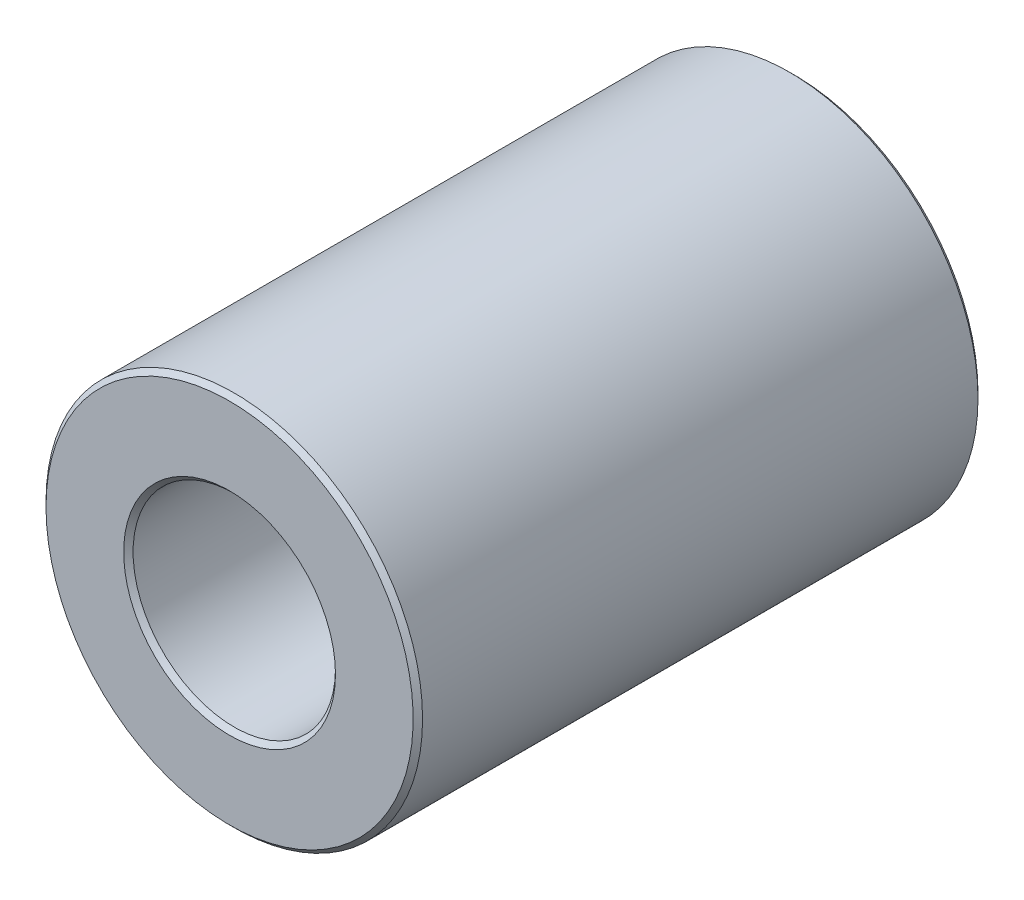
ISO-10303-21;
HEADER;
FILE_DESCRIPTION(('STEP AP214'),'2;1');
FILE_NAME('part.step','',(''),(''),'','','');
FILE_SCHEMA(('AUTOMOTIVE_DESIGN { 1 0 10303 214 1 1 1 1 }'));
ENDSEC;
DATA;
#1=APPLICATION_CONTEXT('core data for automotive mechanical design processes');
#2=APPLICATION_PROTOCOL_DEFINITION('international standard','automotive_design',2000,#1);
#3=PRODUCT_CONTEXT('',#1,'mechanical');
#4=PRODUCT('Part','Part','',(#3));
#5=PRODUCT_RELATED_PRODUCT_CATEGORY('part','',(#4));
#6=PRODUCT_DEFINITION_FORMATION('','',#4);
#7=PRODUCT_DEFINITION_CONTEXT('part definition',#1,'design');
#8=PRODUCT_DEFINITION('design','',#6,#7);
#9=PRODUCT_DEFINITION_SHAPE('','',#8);
#10=(LENGTH_UNIT() NAMED_UNIT(*) SI_UNIT(.MILLI.,.METRE.));
#11=(NAMED_UNIT(*) PLANE_ANGLE_UNIT() SI_UNIT($,.RADIAN.));
#12=(NAMED_UNIT(*) SI_UNIT($,.STERADIAN.) SOLID_ANGLE_UNIT());
#13=UNCERTAINTY_MEASURE_WITH_UNIT(LENGTH_MEASURE(1.E-05),#10,'distance_accuracy_value','');
#14=(GEOMETRIC_REPRESENTATION_CONTEXT(3) GLOBAL_UNCERTAINTY_ASSIGNED_CONTEXT((#13)) GLOBAL_UNIT_ASSIGNED_CONTEXT((#10,
#11,#12)) REPRESENTATION_CONTEXT('',''));
#15=CARTESIAN_POINT('',(0.,0.,0.));
#16=DIRECTION('',(0.,0.,1.));
#17=DIRECTION('',(1.,0.,0.));
#18=AXIS2_PLACEMENT_3D('',#15,#16,#17);
#19=CARTESIAN_POINT('',(0.,0.,6.));
#20=DIRECTION('',(0.,0.,1.));
#21=DIRECTION('',(1.,0.,0.));
#22=AXIS2_PLACEMENT_3D('',#19,#20,#21);
#23=PLANE('',#22);
#24=CARTESIAN_POINT('',(0.,0.,6.));
#25=DIRECTION('',(0.,0.,1.));
#26=DIRECTION('',(1.,0.,0.));
#27=AXIS2_PLACEMENT_3D('',#24,#25,#26);
#28=CIRCLE('',#27,2.25);
#29=CARTESIAN_POINT('',(2.25,0.,6.));
#30=VERTEX_POINT('',#29);
#31=EDGE_CURVE('E10',#30,#30,#28,.F.);
#32=ORIENTED_EDGE('',*,*,#31,.T.);
#33=EDGE_LOOP('',(#32));
#34=FACE_BOUND('',#33,.T.);
#35=CARTESIAN_POINT('',(0.,0.,6.));
#36=DIRECTION('',(0.,0.,1.));
#37=DIRECTION('',(1.,0.,0.));
#38=AXIS2_PLACEMENT_3D('',#35,#36,#37);
#39=CIRCLE('',#38,3.9);
#40=CARTESIAN_POINT('',(-3.9,0.,6.));
#41=VERTEX_POINT('',#40);
#42=EDGE_CURVE('E45',#41,#41,#39,.T.);
#43=ORIENTED_EDGE('',*,*,#42,.T.);
#44=EDGE_LOOP('',(#43));
#45=FACE_BOUND('',#44,.T.);
#46=ADVANCED_FACE('F37',(#34,#45),#23,.T.);
#47=CARTESIAN_POINT('',(0.,0.,-6.));
#48=DIRECTION('',(0.,0.,1.));
#49=DIRECTION('',(1.,0.,0.));
#50=AXIS2_PLACEMENT_3D('',#47,#48,#49);
#51=PLANE('',#50);
#52=CARTESIAN_POINT('',(0.,0.,-6.));
#53=DIRECTION('',(0.,0.,1.));
#54=DIRECTION('',(1.,0.,0.));
#55=AXIS2_PLACEMENT_3D('',#52,#53,#54);
#56=CIRCLE('',#55,3.9);
#57=CARTESIAN_POINT('',(3.9,0.,-6.));
#58=VERTEX_POINT('',#57);
#59=EDGE_CURVE('E63',#58,#58,#56,.F.);
#60=ORIENTED_EDGE('',*,*,#59,.T.);
#61=EDGE_LOOP('',(#60));
#62=FACE_BOUND('',#61,.T.);
#63=CARTESIAN_POINT('',(0.,0.,-6.));
#64=DIRECTION('',(0.,0.,1.));
#65=DIRECTION('',(1.,0.,0.));
#66=AXIS2_PLACEMENT_3D('',#63,#64,#65);
#67=CIRCLE('',#66,2.25);
#68=CARTESIAN_POINT('',(2.25,0.,-6.));
#69=VERTEX_POINT('',#68);
#70=EDGE_CURVE('E67',#69,#69,#67,.T.);
#71=ORIENTED_EDGE('',*,*,#70,.T.);
#72=EDGE_LOOP('',(#71));
#73=FACE_BOUND('',#72,.T.);
#74=ADVANCED_FACE('F89',(#62,#73),#51,.F.);
#75=CARTESIAN_POINT('',(0.,0.,6.));
#76=DIRECTION('',(0.,0.,-1.));
#77=DIRECTION('',(-1.,0.,0.));
#78=AXIS2_PLACEMENT_3D('',#75,#76,#77);
#79=CYLINDRICAL_SURFACE('',#78,4.);
#80=CARTESIAN_POINT('',(0.,0.,-5.9));
#81=DIRECTION('',(0.,0.,1.));
#82=DIRECTION('',(1.,0.,0.));
#83=AXIS2_PLACEMENT_3D('',#80,#81,#82);
#84=CIRCLE('',#83,4.);
#85=CARTESIAN_POINT('',(4.,0.,-5.9));
#86=VERTEX_POINT('',#85);
#87=EDGE_CURVE('E71',#86,#86,#84,.T.);
#88=ORIENTED_EDGE('',*,*,#87,.T.);
#89=EDGE_LOOP('',(#88));
#90=FACE_BOUND('',#89,.T.);
#91=CARTESIAN_POINT('',(0.,0.,5.9));
#92=DIRECTION('',(0.,0.,1.));
#93=DIRECTION('',(1.,0.,0.));
#94=AXIS2_PLACEMENT_3D('',#91,#92,#93);
#95=CIRCLE('',#94,4.);
#96=CARTESIAN_POINT('',(-4.,0.,5.9));
#97=VERTEX_POINT('',#96);
#98=EDGE_CURVE('E74',#97,#97,#95,.F.);
#99=ORIENTED_EDGE('',*,*,#98,.T.);
#100=EDGE_LOOP('',(#99));
#101=FACE_BOUND('',#100,.T.);
#102=ADVANCED_FACE('F78',(#90,#101),#79,.T.);
#103=CARTESIAN_POINT('',(0.,0.,6.));
#104=DIRECTION('',(0.,0.,-1.));
#105=DIRECTION('',(-1.,0.,0.));
#106=AXIS2_PLACEMENT_3D('',#103,#104,#105);
#107=CYLINDRICAL_SURFACE('',#106,2.15);
#108=CARTESIAN_POINT('',(0.,0.,-5.9));
#109=DIRECTION('',(0.,0.,1.));
#110=DIRECTION('',(1.,0.,0.));
#111=AXIS2_PLACEMENT_3D('',#108,#109,#110);
#112=CIRCLE('',#111,2.15);
#113=CARTESIAN_POINT('',(2.15,0.,-5.9));
#114=VERTEX_POINT('',#113);
#115=EDGE_CURVE('E51',#114,#114,#112,.F.);
#116=ORIENTED_EDGE('',*,*,#115,.T.);
#117=EDGE_LOOP('',(#116));
#118=FACE_BOUND('',#117,.T.);
#119=CARTESIAN_POINT('',(0.,0.,5.9));
#120=DIRECTION('',(0.,0.,1.));
#121=DIRECTION('',(1.,0.,0.));
#122=AXIS2_PLACEMENT_3D('',#119,#120,#121);
#123=CIRCLE('',#122,2.15);
#124=CARTESIAN_POINT('',(2.15,0.,5.9));
#125=VERTEX_POINT('',#124);
#126=EDGE_CURVE('E57',#125,#125,#123,.T.);
#127=ORIENTED_EDGE('',*,*,#126,.T.);
#128=EDGE_LOOP('',(#127));
#129=FACE_BOUND('',#128,.T.);
#130=ADVANCED_FACE('F97',(#118,#129),#107,.F.);
#131=CARTESIAN_POINT('',(0.,0.,-5.9));
#132=DIRECTION('',(0.,0.,1.));
#133=DIRECTION('',(1.,0.,0.));
#134=AXIS2_PLACEMENT_3D('',#131,#132,#133);
#135=CONICAL_SURFACE('',#134,4.,0.78539816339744);
#136=ORIENTED_EDGE('',*,*,#59,.F.);
#137=EDGE_LOOP('',(#136));
#138=FACE_BOUND('',#137,.T.);
#139=ORIENTED_EDGE('',*,*,#87,.F.);
#140=EDGE_LOOP('',(#139));
#141=FACE_BOUND('',#140,.T.);
#142=ADVANCED_FACE('F102',(#138,#141),#135,.T.);
#143=CARTESIAN_POINT('',(0.,0.,-6.));
#144=DIRECTION('',(0.,0.,-1.));
#145=DIRECTION('',(-1.,0.,0.));
#146=AXIS2_PLACEMENT_3D('',#143,#144,#145);
#147=CONICAL_SURFACE('',#146,2.25,0.785398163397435);
#148=ORIENTED_EDGE('',*,*,#115,.F.);
#149=EDGE_LOOP('',(#148));
#150=FACE_BOUND('',#149,.T.);
#151=ORIENTED_EDGE('',*,*,#70,.F.);
#152=EDGE_LOOP('',(#151));
#153=FACE_BOUND('',#152,.T.);
#154=ADVANCED_FACE('F86',(#150,#153),#147,.F.);
#155=CARTESIAN_POINT('',(0.,0.,5.9));
#156=DIRECTION('',(0.,0.,1.));
#157=DIRECTION('',(1.,0.,0.));
#158=AXIS2_PLACEMENT_3D('',#155,#156,#157);
#159=CONICAL_SURFACE('',#158,2.15,0.78539816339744);
#160=ORIENTED_EDGE('',*,*,#31,.F.);
#161=EDGE_LOOP('',(#160));
#162=FACE_BOUND('',#161,.T.);
#163=ORIENTED_EDGE('',*,*,#126,.F.);
#164=EDGE_LOOP('',(#163));
#165=FACE_BOUND('',#164,.T.);
#166=ADVANCED_FACE('F82',(#162,#165),#159,.F.);
#167=CARTESIAN_POINT('',(0.,0.,6.));
#168=DIRECTION('',(0.,0.,-1.));
#169=DIRECTION('',(-1.,0.,0.));
#170=AXIS2_PLACEMENT_3D('',#167,#168,#169);
#171=CONICAL_SURFACE('',#170,3.9,0.785398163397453);
#172=CARTESIAN_POINT('',(-4.,0.,5.9));
#173=CARTESIAN_POINT('',(-3.99895833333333,0.,5.90104166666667));
#174=CARTESIAN_POINT('',(-3.99791666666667,0.,5.90208333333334));
#175=CARTESIAN_POINT('',(-3.99583333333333,0.,5.90416666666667));
#176=CARTESIAN_POINT('',(-3.99479166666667,0.,5.90520833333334));
#177=CARTESIAN_POINT('',(-3.99270833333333,0.,5.90729166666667));
#178=CARTESIAN_POINT('',(-3.99166666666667,0.,5.90833333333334));
#179=CARTESIAN_POINT('',(-3.98958333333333,0.,5.91041666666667));
#180=CARTESIAN_POINT('',(-3.98854166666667,0.,5.91145833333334));
#181=CARTESIAN_POINT('',(-3.98645833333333,0.,5.91354166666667));
#182=CARTESIAN_POINT('',(-3.98541666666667,0.,5.91458333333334));
#183=CARTESIAN_POINT('',(-3.98333333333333,0.,5.91666666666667));
#184=CARTESIAN_POINT('',(-3.98229166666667,0.,5.91770833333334));
#185=CARTESIAN_POINT('',(-3.98020833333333,0.,5.91979166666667));
#186=CARTESIAN_POINT('',(-3.97916666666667,0.,5.92083333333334));
#187=CARTESIAN_POINT('',(-3.97708333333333,0.,5.92291666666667));
#188=CARTESIAN_POINT('',(-3.97604166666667,0.,5.92395833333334));
#189=CARTESIAN_POINT('',(-3.97395833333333,0.,5.92604166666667));
#190=CARTESIAN_POINT('',(-3.97291666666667,0.,5.92708333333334));
#191=CARTESIAN_POINT('',(-3.97083333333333,0.,5.92916666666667));
#192=CARTESIAN_POINT('',(-3.96979166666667,0.,5.93020833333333));
#193=CARTESIAN_POINT('',(-3.96770833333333,0.,5.93229166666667));
#194=CARTESIAN_POINT('',(-3.96666666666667,0.,5.93333333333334));
#195=CARTESIAN_POINT('',(-3.96458333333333,0.,5.93541666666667));
#196=CARTESIAN_POINT('',(-3.96354166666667,0.,5.93645833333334));
#197=CARTESIAN_POINT('',(-3.96145833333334,0.,5.93854166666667));
#198=CARTESIAN_POINT('',(-3.96041666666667,0.,5.93958333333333));
#199=CARTESIAN_POINT('',(-3.95833333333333,0.,5.94166666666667));
#200=CARTESIAN_POINT('',(-3.95729166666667,0.,5.94270833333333));
#201=CARTESIAN_POINT('',(-3.95520833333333,0.,5.94479166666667));
#202=CARTESIAN_POINT('',(-3.95416666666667,0.,5.94583333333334));
#203=CARTESIAN_POINT('',(-3.95208333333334,0.,5.94791666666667));
#204=CARTESIAN_POINT('',(-3.95104166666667,0.,5.94895833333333));
#205=CARTESIAN_POINT('',(-3.94895833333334,0.,5.95104166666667));
#206=CARTESIAN_POINT('',(-3.94791666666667,0.,5.95208333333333));
#207=CARTESIAN_POINT('',(-3.94583333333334,0.,5.95416666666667));
#208=CARTESIAN_POINT('',(-3.94479166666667,0.,5.95520833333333));
#209=CARTESIAN_POINT('',(-3.94270833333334,0.,5.95729166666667));
#210=CARTESIAN_POINT('',(-3.94166666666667,0.,5.95833333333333));
#211=CARTESIAN_POINT('',(-3.93958333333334,0.,5.96041666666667));
#212=CARTESIAN_POINT('',(-3.93854166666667,0.,5.96145833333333));
#213=CARTESIAN_POINT('',(-3.93645833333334,0.,5.96354166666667));
#214=CARTESIAN_POINT('',(-3.93541666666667,0.,5.96458333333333));
#215=CARTESIAN_POINT('',(-3.93333333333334,0.,5.96666666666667));
#216=CARTESIAN_POINT('',(-3.93229166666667,0.,5.96770833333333));
#217=CARTESIAN_POINT('',(-3.93020833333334,0.,5.96979166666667));
#218=CARTESIAN_POINT('',(-3.92916666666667,0.,5.97083333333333));
#219=CARTESIAN_POINT('',(-3.92708333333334,0.,5.97291666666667));
#220=CARTESIAN_POINT('',(-3.92604166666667,0.,5.97395833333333));
#221=CARTESIAN_POINT('',(-3.92395833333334,0.,5.97604166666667));
#222=CARTESIAN_POINT('',(-3.92291666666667,0.,5.97708333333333));
#223=CARTESIAN_POINT('',(-3.92083333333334,0.,5.97916666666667));
#224=CARTESIAN_POINT('',(-3.91979166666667,0.,5.98020833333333));
#225=CARTESIAN_POINT('',(-3.91770833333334,0.,5.98229166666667));
#226=CARTESIAN_POINT('',(-3.91666666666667,0.,5.98333333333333));
#227=CARTESIAN_POINT('',(-3.91458333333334,0.,5.98541666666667));
#228=CARTESIAN_POINT('',(-3.91354166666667,0.,5.98645833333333));
#229=CARTESIAN_POINT('',(-3.91145833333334,0.,5.98854166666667));
#230=CARTESIAN_POINT('',(-3.91041666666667,0.,5.98958333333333));
#231=CARTESIAN_POINT('',(-3.90833333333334,0.,5.99166666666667));
#232=CARTESIAN_POINT('',(-3.90729166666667,0.,5.99270833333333));
#233=CARTESIAN_POINT('',(-3.90520833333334,0.,5.99479166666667));
#234=CARTESIAN_POINT('',(-3.90416666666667,0.,5.99583333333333));
#235=CARTESIAN_POINT('',(-3.90208333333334,0.,5.99791666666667));
#236=CARTESIAN_POINT('',(-3.90104166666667,0.,5.99895833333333));
#237=CARTESIAN_POINT('',(-3.9,0.,6.));
#238=B_SPLINE_CURVE_WITH_KNOTS('',3,(#172,#173,#174,#175,#176,#177,#178,#179,#180,#181,#182,
#183,#184,#185,#186,#187,#188,#189,#190,#191,#192,#193,#194,#195,#196,#197,#198,#199,#200,#201,
#202,#203,#204,#205,#206,#207,#208,#209,#210,#211,#212,#213,#214,#215,#216,#217,#218,#219,#220,
#221,#222,#223,#224,#225,#226,#227,#228,#229,#230,#231,#232,#233,#234,#235,#236,#237),
.UNSPECIFIED.,.F.,.F.,(4,2,2,2,2,2,2,2,2,2,2,2,2,2,2,2,2,2,2,2,2,2,2,2,2,2,2,2,2,2,2,2,4),(0.,
0.00441941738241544,0.00883883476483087,0.0132582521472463,0.017677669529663,0.0220970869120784,
0.0265165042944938,0.0309359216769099,0.0353553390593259,0.0397747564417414,0.0441941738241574,
0.0486135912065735,0.0530330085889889,0.057452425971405,0.0618718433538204,0.0662912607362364,
0.0707106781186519,0.0751300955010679,0.079549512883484,0.0839689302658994,0.0883883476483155,
0.0928077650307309,0.097227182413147,0.101646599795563,0.106066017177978,0.110485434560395,
0.114904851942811,0.119324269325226,0.123743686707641,0.128163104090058,0.132582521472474,
0.137001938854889,0.141421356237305),.UNSPECIFIED.);
#239=EDGE_CURVE('BSEAM39',#97,#41,#238,.T.);
#240=ORIENTED_EDGE('',*,*,#98,.F.);
#241=ORIENTED_EDGE('',*,*,#42,.F.);
#242=ORIENTED_EDGE('',*,*,#239,.T.);
#243=ORIENTED_EDGE('',*,*,#239,.F.);
#244=EDGE_LOOP('',(#240,#242,#241,#243));
#245=FACE_BOUND('',#244,.T.);
#246=ADVANCED_FACE('F39',(#245),#171,.T.);
#247=CLOSED_SHELL('',(#46,#74,#102,#130,#142,#154,#166,#246));
#248=MANIFOLD_SOLID_BREP('B2',#247);
#249=ADVANCED_BREP_SHAPE_REPRESENTATION('',(#18,#248),#14);
#250=SHAPE_DEFINITION_REPRESENTATION(#9,#249);
ENDSEC;
END-ISO-10303-21;
